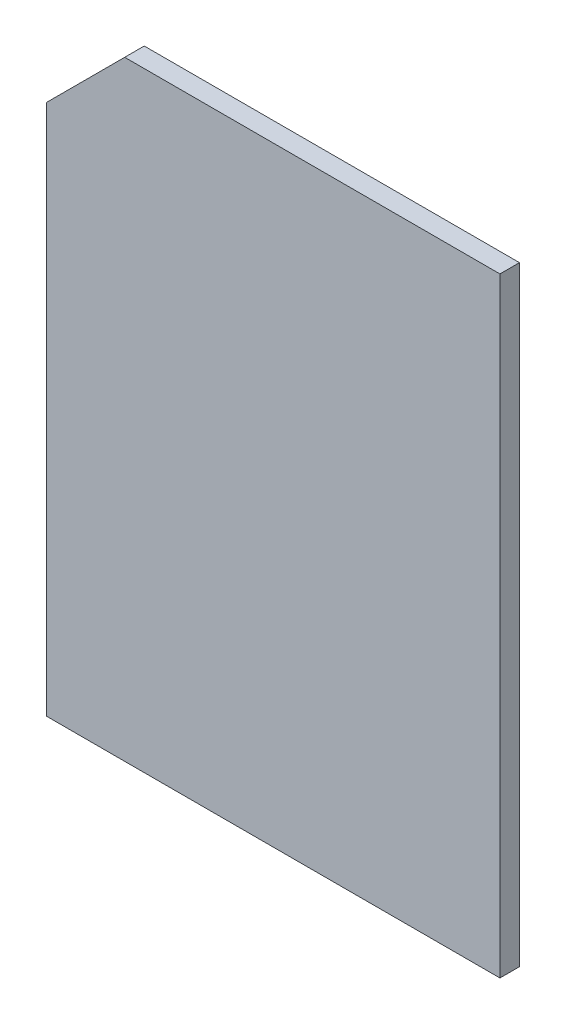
from build123d import *

# Parameters (mm, degrees)
BOSS_EXTRUDE1_DEPTH = 1.5875


with BuildPart() as part:
    # Sketch1 → Boss-Extrude1 (new body)
    with BuildSketch(Plane.XY):
        Polygon((0, 0), (-36.83, 0), (-36.83, 43.18), (-30.48, 49.53), (0, 49.53), align=None)
    extrude(amount=BOSS_EXTRUDE1_DEPTH)


solid = part.part
